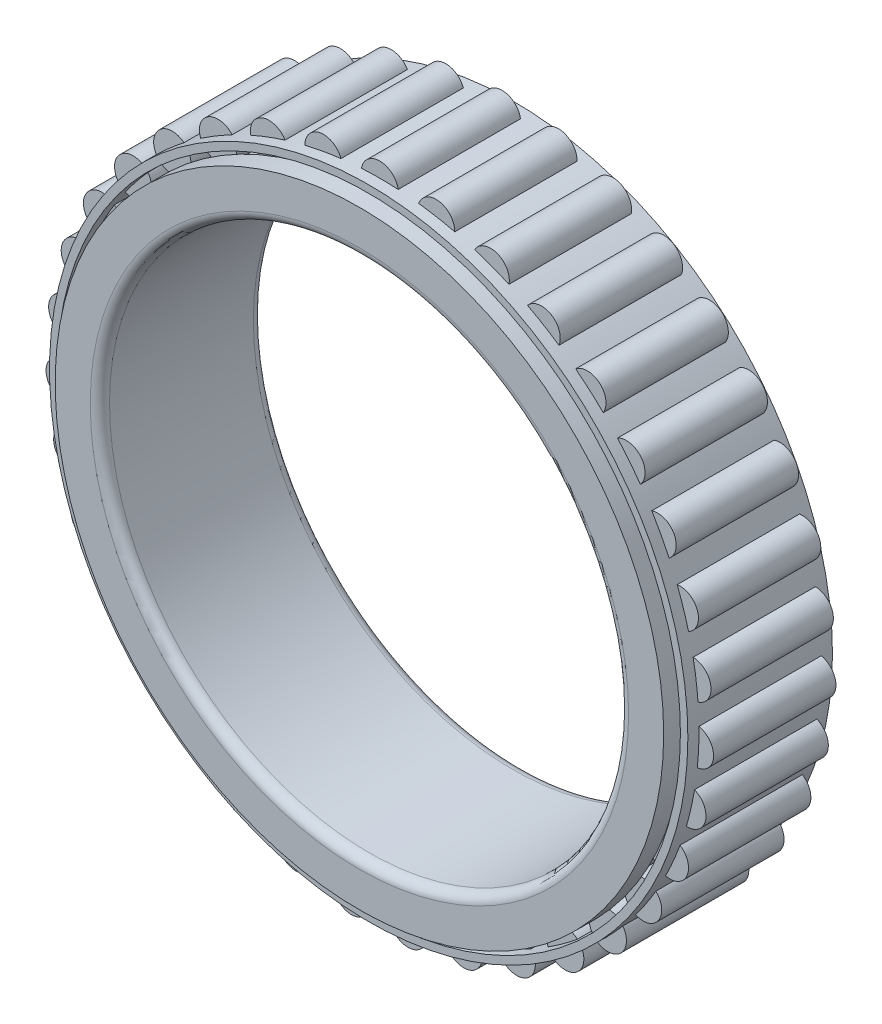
from build123d import *

# Parameters (mm, degrees)
BASESKE_W            = 16.5
BASESKE_H            = 2.5125
CAGESKE_W            = 19.5
CAGESKE_H            = 1.005
FILLET1_R            = 1.3
CIRPATTERNBALL_COUNT = 35


with BuildPart() as part:
    # BaseSke → Roller (revolve)
    with BuildSketch(Plane(origin=(0, 0, 0), x_dir=(0, 0, -1), z_dir=(1, 0, 0)), mode=Mode.PRIVATE) as roller_sk:
        with Locations((0, 41.28125)):
            Rectangle(BASESKE_W, BASESKE_H)
    roller = revolve(roller_sk.sketch.rotate(Axis((0, 42.5375, 8.25), (0, 0, -1)), 270), axis=Axis((0, 42.5375, 8.25), (0, 0, -1)))

    # OuterRaceSke → OuterRace (revolve)
    with BuildSketch(Plane(origin=(0, 0, 0), x_dir=(0, 0, -1), z_dir=(1, 0, 0)), mode=Mode.PRIVATE) as outerrace_sk:
        Polygon((-11, 35), (11, 35), (11, 41.03), (8.275, 41.03), (8.275, 40.045), (-8.275, 40.045), (-8.275, 41.03), (-11, 41.03), align=None)
    revolve(outerrace_sk.sketch.rotate(Axis((0, 0, 50.391616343), (0, 0, -1)), 90), axis=Axis((0, 0, 50.391616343), (0, 0, -1)))

    # CageSke → Cage (revolve)
    with BuildSketch(Plane(origin=(0, 0, 0), x_dir=(0, 0, -1), z_dir=(1, 0, 0)), mode=Mode.PRIVATE) as cage_sk:
        with Locations((0, 42.5375)):
            Rectangle(CAGESKE_W, CAGESKE_H)
    revolve(cage_sk.sketch.rotate(Axis((0, 0, 70.862590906), (0, 0, -1)), 90), axis=Axis((0, 0, 70.862590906), (0, 0, -1)))

    # Fillet1
    fillet1_edges = [part.edges().sort_by_distance(p)[0] for p in [
        (-35, 0, -11),
        (-35, 0, 11),
    ]]
    fillet(fillet1_edges, radius=FILLET1_R)

    # CirPatternBall: Roller ×35 about axis
    cirpatternball_axis = Axis((0, 0, 0), (0, 0, 1))
    for i in range(1, CIRPATTERNBALL_COUNT):
        add(roller.rotate(cirpatternball_axis, i * 360 / CIRPATTERNBALL_COUNT))


solid = part.part
